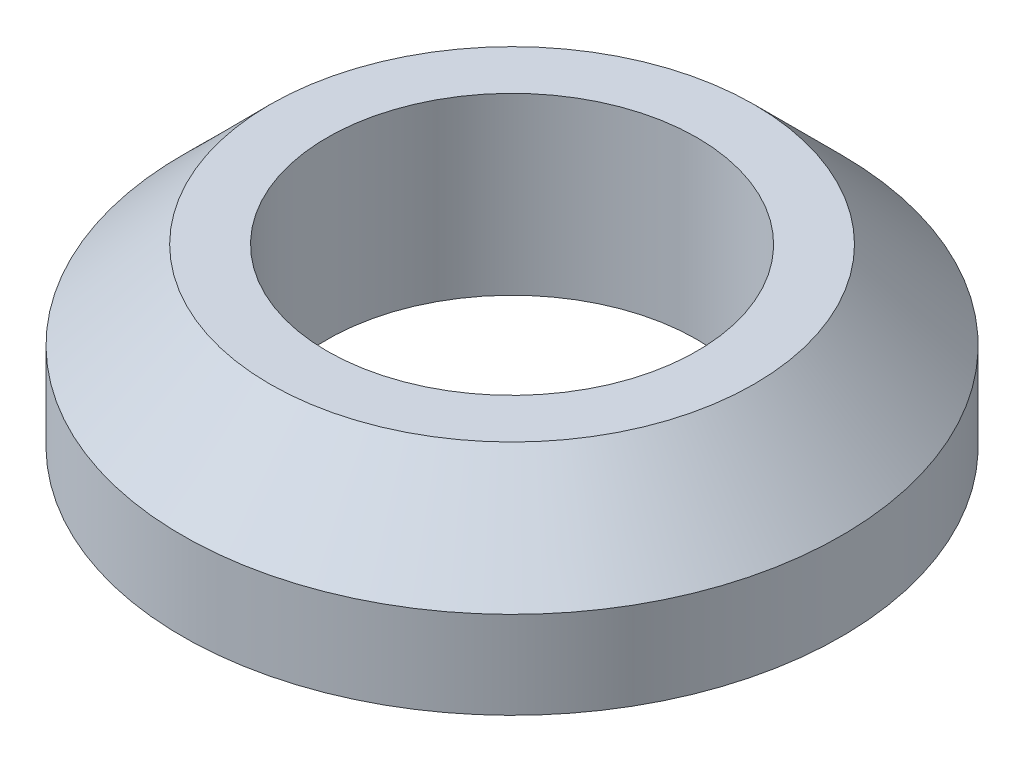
ISO-10303-21;
HEADER;
FILE_DESCRIPTION(('STEP AP214'),'2;1');
FILE_NAME('part.step','',(''),(''),'','','');
FILE_SCHEMA(('AUTOMOTIVE_DESIGN { 1 0 10303 214 1 1 1 1 }'));
ENDSEC;
DATA;
#1=APPLICATION_CONTEXT('core data for automotive mechanical design processes');
#2=APPLICATION_PROTOCOL_DEFINITION('international standard','automotive_design',2000,#1);
#3=PRODUCT_CONTEXT('',#1,'mechanical');
#4=PRODUCT('Part','Part','',(#3));
#5=PRODUCT_RELATED_PRODUCT_CATEGORY('part','',(#4));
#6=PRODUCT_DEFINITION_FORMATION('','',#4);
#7=PRODUCT_DEFINITION_CONTEXT('part definition',#1,'design');
#8=PRODUCT_DEFINITION('design','',#6,#7);
#9=PRODUCT_DEFINITION_SHAPE('','',#8);
#10=(LENGTH_UNIT() NAMED_UNIT(*) SI_UNIT(.MILLI.,.METRE.));
#11=(NAMED_UNIT(*) PLANE_ANGLE_UNIT() SI_UNIT($,.RADIAN.));
#12=(NAMED_UNIT(*) SI_UNIT($,.STERADIAN.) SOLID_ANGLE_UNIT());
#13=UNCERTAINTY_MEASURE_WITH_UNIT(LENGTH_MEASURE(1.E-05),#10,'distance_accuracy_value','');
#14=(GEOMETRIC_REPRESENTATION_CONTEXT(3) GLOBAL_UNCERTAINTY_ASSIGNED_CONTEXT((#13)) GLOBAL_UNIT_ASSIGNED_CONTEXT((#10,
#11,#12)) REPRESENTATION_CONTEXT('',''));
#15=CARTESIAN_POINT('',(0.,0.,0.));
#16=DIRECTION('',(0.,0.,1.));
#17=DIRECTION('',(1.,0.,0.));
#18=AXIS2_PLACEMENT_3D('',#15,#16,#17);
#19=CARTESIAN_POINT('',(4.9,0.,0.));
#20=DIRECTION('',(0.,-1.,0.));
#21=DIRECTION('',(0.,0.,-1.));
#22=AXIS2_PLACEMENT_3D('',#19,#20,#21);
#23=PLANE('',#22);
#24=CARTESIAN_POINT('',(0.,0.,0.));
#25=DIRECTION('',(0.,-1.,0.));
#26=DIRECTION('',(0.,0.,-1.));
#27=AXIS2_PLACEMENT_3D('',#24,#25,#26);
#28=CIRCLE('',#27,4.9);
#29=CARTESIAN_POINT('',(0.,0.,-4.9));
#30=VERTEX_POINT('',#29);
#31=EDGE_CURVE('E31',#30,#30,#28,.T.);
#32=ORIENTED_EDGE('',*,*,#31,.T.);
#33=EDGE_LOOP('',(#32));
#34=FACE_BOUND('',#33,.T.);
#35=CARTESIAN_POINT('',(0.,0.,0.));
#36=DIRECTION('',(0.,-1.,0.));
#37=DIRECTION('',(0.,0.,-1.));
#38=AXIS2_PLACEMENT_3D('',#35,#36,#37);
#39=CIRCLE('',#38,2.75);
#40=CARTESIAN_POINT('',(0.,0.,-2.75));
#41=VERTEX_POINT('',#40);
#42=EDGE_CURVE('E8',#41,#41,#39,.T.);
#43=ORIENTED_EDGE('',*,*,#42,.F.);
#44=EDGE_LOOP('',(#43));
#45=FACE_BOUND('',#44,.T.);
#46=ADVANCED_FACE('F12',(#34,#45),#23,.T.);
#47=CARTESIAN_POINT('',(0.,0.,0.));
#48=DIRECTION('',(0.,-1.,0.));
#49=DIRECTION('',(0.,0.,-1.));
#50=AXIS2_PLACEMENT_3D('',#47,#48,#49);
#51=CYLINDRICAL_SURFACE('',#50,2.75);
#52=ORIENTED_EDGE('',*,*,#42,.T.);
#53=EDGE_LOOP('',(#52));
#54=FACE_BOUND('',#53,.T.);
#55=CARTESIAN_POINT('',(0.,2.6,0.));
#56=DIRECTION('',(0.,-1.,0.));
#57=DIRECTION('',(0.,0.,-1.));
#58=AXIS2_PLACEMENT_3D('',#55,#56,#57);
#59=CIRCLE('',#58,2.75);
#60=CARTESIAN_POINT('',(0.,2.6,-2.75));
#61=VERTEX_POINT('',#60);
#62=EDGE_CURVE('E18',#61,#61,#59,.T.);
#63=ORIENTED_EDGE('',*,*,#62,.F.);
#64=EDGE_LOOP('',(#63));
#65=FACE_BOUND('',#64,.T.);
#66=ADVANCED_FACE('F51',(#54,#65),#51,.F.);
#67=CARTESIAN_POINT('',(2.75,2.6,0.));
#68=DIRECTION('',(0.,1.,0.));
#69=DIRECTION('',(0.,0.,1.));
#70=AXIS2_PLACEMENT_3D('',#67,#68,#69);
#71=PLANE('',#70);
#72=ORIENTED_EDGE('',*,*,#62,.T.);
#73=EDGE_LOOP('',(#72));
#74=FACE_BOUND('',#73,.T.);
#75=CARTESIAN_POINT('',(0.,2.6,0.));
#76=DIRECTION('',(0.,-1.,0.));
#77=DIRECTION('',(0.,0.,-1.));
#78=AXIS2_PLACEMENT_3D('',#75,#76,#77);
#79=CIRCLE('',#78,3.6);
#80=CARTESIAN_POINT('',(0.,2.6,-3.6));
#81=VERTEX_POINT('',#80);
#82=EDGE_CURVE('E22',#81,#81,#79,.T.);
#83=ORIENTED_EDGE('',*,*,#82,.F.);
#84=EDGE_LOOP('',(#83));
#85=FACE_BOUND('',#84,.T.);
#86=ADVANCED_FACE('F47',(#74,#85),#71,.T.);
#87=CARTESIAN_POINT('',(0.,1.3,0.));
#88=DIRECTION('',(0.,-1.,0.));
#89=DIRECTION('',(0.,0.,-1.));
#90=AXIS2_PLACEMENT_3D('',#87,#88,#89);
#91=CONICAL_SURFACE('',#90,4.9,0.785398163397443);
#92=ORIENTED_EDGE('',*,*,#82,.T.);
#93=EDGE_LOOP('',(#92));
#94=FACE_BOUND('',#93,.T.);
#95=CARTESIAN_POINT('',(0.,1.3,0.));
#96=DIRECTION('',(0.,-1.,0.));
#97=DIRECTION('',(0.,0.,-1.));
#98=AXIS2_PLACEMENT_3D('',#95,#96,#97);
#99=CIRCLE('',#98,4.9);
#100=CARTESIAN_POINT('',(0.,1.3,-4.9));
#101=VERTEX_POINT('',#100);
#102=EDGE_CURVE('E26',#101,#101,#99,.T.);
#103=ORIENTED_EDGE('',*,*,#102,.F.);
#104=EDGE_LOOP('',(#103));
#105=FACE_BOUND('',#104,.T.);
#106=ADVANCED_FACE('F39',(#94,#105),#91,.T.);
#107=CARTESIAN_POINT('',(0.,0.,0.));
#108=DIRECTION('',(0.,-1.,0.));
#109=DIRECTION('',(0.,0.,-1.));
#110=AXIS2_PLACEMENT_3D('',#107,#108,#109);
#111=CYLINDRICAL_SURFACE('',#110,4.9);
#112=ORIENTED_EDGE('',*,*,#102,.T.);
#113=EDGE_LOOP('',(#112));
#114=FACE_BOUND('',#113,.T.);
#115=ORIENTED_EDGE('',*,*,#31,.F.);
#116=EDGE_LOOP('',(#115));
#117=FACE_BOUND('',#116,.T.);
#118=ADVANCED_FACE('F37',(#114,#117),#111,.T.);
#119=CLOSED_SHELL('',(#46,#66,#86,#106,#118));
#120=MANIFOLD_SOLID_BREP('B1',#119);
#121=ADVANCED_BREP_SHAPE_REPRESENTATION('',(#18,#120),#14);
#122=SHAPE_DEFINITION_REPRESENTATION(#9,#121);
ENDSEC;
END-ISO-10303-21;
